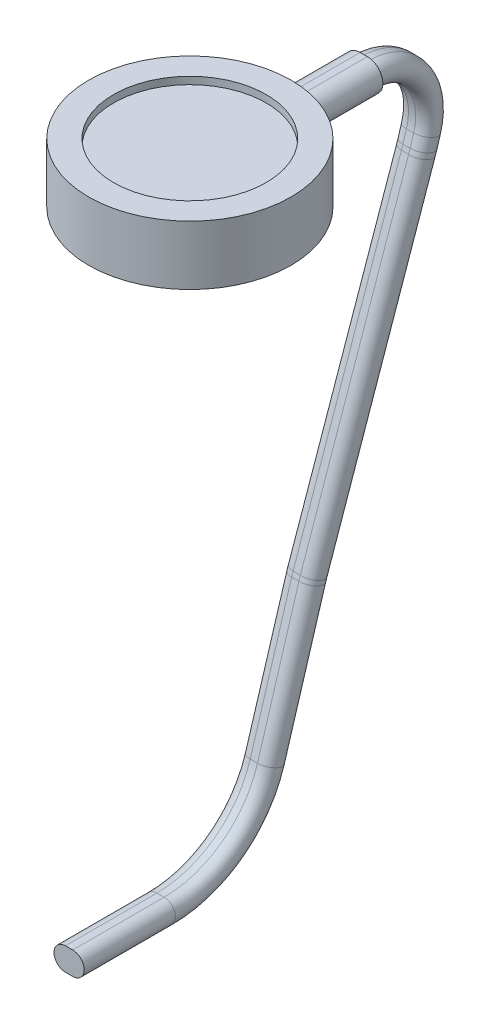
ISO-10303-21;
HEADER;
FILE_DESCRIPTION(('STEP AP214'),'2;1');
FILE_NAME('part.step','',(''),(''),'','','');
FILE_SCHEMA(('AUTOMOTIVE_DESIGN { 1 0 10303 214 1 1 1 1 }'));
ENDSEC;
DATA;
#1=APPLICATION_CONTEXT('core data for automotive mechanical design processes');
#2=APPLICATION_PROTOCOL_DEFINITION('international standard','automotive_design',2000,#1);
#3=PRODUCT_CONTEXT('',#1,'mechanical');
#4=PRODUCT('Part','Part','',(#3));
#5=PRODUCT_RELATED_PRODUCT_CATEGORY('part','',(#4));
#6=PRODUCT_DEFINITION_FORMATION('','',#4);
#7=PRODUCT_DEFINITION_CONTEXT('part definition',#1,'design');
#8=PRODUCT_DEFINITION('design','',#6,#7);
#9=PRODUCT_DEFINITION_SHAPE('','',#8);
#10=(LENGTH_UNIT() NAMED_UNIT(*) SI_UNIT(.MILLI.,.METRE.));
#11=(NAMED_UNIT(*) PLANE_ANGLE_UNIT() SI_UNIT($,.RADIAN.));
#12=(NAMED_UNIT(*) SI_UNIT($,.STERADIAN.) SOLID_ANGLE_UNIT());
#13=UNCERTAINTY_MEASURE_WITH_UNIT(LENGTH_MEASURE(1.E-05),#10,'distance_accuracy_value','');
#14=(GEOMETRIC_REPRESENTATION_CONTEXT(3) GLOBAL_UNCERTAINTY_ASSIGNED_CONTEXT((#13)) GLOBAL_UNIT_ASSIGNED_CONTEXT((#10,
#11,#12)) REPRESENTATION_CONTEXT('',''));
#15=CARTESIAN_POINT('',(0.,0.,0.));
#16=DIRECTION('',(0.,0.,1.));
#17=DIRECTION('',(1.,0.,0.));
#18=AXIS2_PLACEMENT_3D('',#15,#16,#17);
#19=CARTESIAN_POINT('',(0.,0.,-23.925));
#20=DIRECTION('',(0.,0.,-1.));
#21=DIRECTION('',(-1.,0.,0.));
#22=AXIS2_PLACEMENT_3D('',#19,#20,#21);
#23=PLANE('',#22);
#24=CARTESIAN_POINT('',(-0.5,0.,-23.925));
#25=DIRECTION('',(0.,0.,-1.));
#26=DIRECTION('',(-1.,0.,0.));
#27=AXIS2_PLACEMENT_3D('',#24,#25,#26);
#28=CIRCLE('',#27,2.125);
#29=CARTESIAN_POINT('',(-0.5,2.125,-23.925));
#30=VERTEX_POINT('',#29);
#31=CARTESIAN_POINT('',(-0.5,-2.125,-23.925));
#32=VERTEX_POINT('',#31);
#33=EDGE_CURVE('E390',#30,#32,#28,.F.);
#34=ORIENTED_EDGE('',*,*,#33,.F.);
#35=DIRECTION('',(1.,0.,0.));
#36=VECTOR('',#35,1.);
#37=CARTESIAN_POINT('',(-0.5,2.125,-23.925));
#38=LINE('',#37,#36);
#39=CARTESIAN_POINT('',(0.5,2.125,-23.925));
#40=VERTEX_POINT('',#39);
#41=EDGE_CURVE('E389',#30,#40,#38,.T.);
#42=ORIENTED_EDGE('',*,*,#41,.T.);
#43=CARTESIAN_POINT('',(0.5,0.,-23.925));
#44=DIRECTION('',(0.,0.,-1.));
#45=DIRECTION('',(-1.,0.,0.));
#46=AXIS2_PLACEMENT_3D('',#43,#44,#45);
#47=CIRCLE('',#46,2.125);
#48=CARTESIAN_POINT('',(0.500000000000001,-2.125,-23.925));
#49=VERTEX_POINT('',#48);
#50=EDGE_CURVE('E395',#49,#40,#47,.F.);
#51=ORIENTED_EDGE('',*,*,#50,.F.);
#52=DIRECTION('',(1.,0.,0.));
#53=VECTOR('',#52,1.);
#54=CARTESIAN_POINT('',(-0.5,-2.125,-23.925));
#55=LINE('',#54,#53);
#56=EDGE_CURVE('E400',#32,#49,#55,.T.);
#57=ORIENTED_EDGE('',*,*,#56,.F.);
#58=EDGE_LOOP('',(#34,#42,#51,#57));
#59=FACE_BOUND('',#58,.T.);
#60=DIRECTION('',(-1.,0.,0.));
#61=VECTOR('',#60,1.);
#62=CARTESIAN_POINT('',(0.5,-1.575,-23.925));
#63=LINE('',#62,#61);
#64=CARTESIAN_POINT('',(0.5,-1.575,-23.925));
#65=VERTEX_POINT('',#64);
#66=CARTESIAN_POINT('',(-0.5,-1.575,-23.925));
#67=VERTEX_POINT('',#66);
#68=EDGE_CURVE('E364',#65,#67,#63,.T.);
#69=ORIENTED_EDGE('',*,*,#68,.F.);
#70=CARTESIAN_POINT('',(0.5,0.,-23.925));
#71=DIRECTION('',(0.,0.,-1.));
#72=DIRECTION('',(-1.,0.,0.));
#73=AXIS2_PLACEMENT_3D('',#70,#71,#72);
#74=CIRCLE('',#73,1.575);
#75=CARTESIAN_POINT('',(0.5,1.575,-23.925));
#76=VERTEX_POINT('',#75);
#77=EDGE_CURVE('E361',#76,#65,#74,.T.);
#78=ORIENTED_EDGE('',*,*,#77,.F.);
#79=DIRECTION('',(1.,0.,0.));
#80=VECTOR('',#79,1.);
#81=CARTESIAN_POINT('',(0.5,1.575,-23.925));
#82=LINE('',#81,#80);
#83=CARTESIAN_POINT('',(-0.499999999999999,1.575,-23.925));
#84=VERTEX_POINT('',#83);
#85=EDGE_CURVE('E368',#84,#76,#82,.T.);
#86=ORIENTED_EDGE('',*,*,#85,.F.);
#87=CARTESIAN_POINT('',(-0.5,0.,-23.925));
#88=DIRECTION('',(0.,0.,-1.));
#89=DIRECTION('',(-1.,0.,0.));
#90=AXIS2_PLACEMENT_3D('',#87,#88,#89);
#91=CIRCLE('',#90,1.575);
#92=EDGE_CURVE('E52',#67,#84,#91,.T.);
#93=ORIENTED_EDGE('',*,*,#92,.F.);
#94=EDGE_LOOP('',(#69,#78,#86,#93));
#95=FACE_BOUND('',#94,.T.);
#96=ADVANCED_FACE('F33',(#59,#95),#23,.T.);
#97=CARTESIAN_POINT('',(0.,4.075,0.));
#98=DIRECTION('',(0.,-1.,0.));
#99=DIRECTION('',(0.,0.,-1.));
#100=AXIS2_PLACEMENT_3D('',#97,#98,#99);
#101=CYLINDRICAL_SURFACE('',#100,13.925);
#102=CARTESIAN_POINT('',(0.,2.125,0.));
#103=DIRECTION('',(0.,-1.,0.));
#104=DIRECTION('',(0.,0.,-1.));
#105=AXIS2_PLACEMENT_3D('',#102,#103,#104);
#106=CIRCLE('',#105,13.925);
#107=CARTESIAN_POINT('',(-0.5,2.125,-13.9160204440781));
#108=VERTEX_POINT('',#107);
#109=CARTESIAN_POINT('',(0.5,2.125,-13.9160204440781));
#110=VERTEX_POINT('',#109);
#111=EDGE_CURVE('E422',#108,#110,#106,.T.);
#112=ORIENTED_EDGE('',*,*,#111,.F.);
#113=CARTESIAN_POINT('',(0.,2.06533895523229,-13.925));
#114=CARTESIAN_POINT('',(-0.1150638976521,2.09318994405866,-13.924998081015));
#115=CARTESIAN_POINT('',(-0.23252616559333,2.11141849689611,-13.9235590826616));
#116=CARTESIAN_POINT('',(-0.468841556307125,2.1280766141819,-13.9176079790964));
#117=CARTESIAN_POINT('',(-0.587695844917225,2.12648818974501,-13.9130930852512));
#118=CARTESIAN_POINT('',(-0.823265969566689,2.10359578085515,-13.9011422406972));
#119=CARTESIAN_POINT('',(-0.939983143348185,2.08230459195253,-13.8937081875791));
#120=CARTESIAN_POINT('',(-1.1680702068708,2.02070866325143,-13.8763946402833));
#121=CARTESIAN_POINT('',(-1.27944078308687,1.98040637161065,-13.8665154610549));
#122=CARTESIAN_POINT('',(-1.49450048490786,1.88166987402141,-13.8449938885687));
#123=CARTESIAN_POINT('',(-1.59813687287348,1.8231231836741,-13.8333407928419));
#124=CARTESIAN_POINT('',(-1.79415664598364,1.68962954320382,-13.809286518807));
#125=CARTESIAN_POINT('',(-1.88653886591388,1.61468089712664,-13.7968852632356));
#126=CARTESIAN_POINT('',(-2.05854002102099,1.44946860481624,-13.7722796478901));
#127=CARTESIAN_POINT('',(-2.13800013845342,1.3590389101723,-13.7600791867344));
#128=CARTESIAN_POINT('',(-2.28061350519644,1.16595232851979,-13.7371634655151));
#129=CARTESIAN_POINT('',(-2.34376689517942,1.06329554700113,-13.7264481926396));
#130=CARTESIAN_POINT('',(-2.45177705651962,0.848861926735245,-13.7075682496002));
#131=CARTESIAN_POINT('',(-2.4966781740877,0.737107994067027,-13.6993974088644));
#132=CARTESIAN_POINT('',(-2.56701160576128,0.507450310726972,-13.6863935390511));
#133=CARTESIAN_POINT('',(-2.5924461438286,0.389547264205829,-13.6815601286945));
#134=CARTESIAN_POINT('',(-2.62279293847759,0.152912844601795,-13.6757749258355));
#135=CARTESIAN_POINT('',(-2.62801966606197,0.0342232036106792,-13.6747636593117));
#136=CARTESIAN_POINT('',(-2.61865403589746,-0.202337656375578,-13.6765601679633));
#137=CARTESIAN_POINT('',(-2.60406269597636,-0.320208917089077,-13.6793677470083));
#138=CARTESIAN_POINT('',(-2.55572283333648,-0.550816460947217,-13.6884804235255));
#139=CARTESIAN_POINT('',(-2.52212868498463,-0.663586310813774,-13.6947573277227));
#140=CARTESIAN_POINT('',(-2.43691429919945,-0.881884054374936,-13.7101764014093));
#141=CARTESIAN_POINT('',(-2.385292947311,-0.987411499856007,-13.719318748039));
#142=CARTESIAN_POINT('',(-2.26487135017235,-1.18946749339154,-13.7397138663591));
#143=CARTESIAN_POINT('',(-2.19589452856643,-1.28588860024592,-13.7509880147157));
#144=CARTESIAN_POINT('',(-2.04297008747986,-1.46588464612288,-13.7745369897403));
#145=CARTESIAN_POINT('',(-1.95902107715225,-1.54945839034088,-13.7868119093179));
#146=CARTESIAN_POINT('',(-1.77708008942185,-1.70265682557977,-13.8114498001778));
#147=CARTESIAN_POINT('',(-1.67889935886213,-1.77205775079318,-13.8238114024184));
#148=CARTESIAN_POINT('',(-1.47214637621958,-1.89338932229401,-13.8473542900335));
#149=CARTESIAN_POINT('',(-1.36357410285,-1.94531993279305,-13.8585355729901));
#150=CARTESIAN_POINT('',(-1.13904824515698,-2.03018331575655,-13.8787927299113));
#151=CARTESIAN_POINT('',(-1.02309456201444,-2.06311583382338,-13.8878685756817));
#152=CARTESIAN_POINT('',(-0.787115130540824,-2.10894124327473,-13.90323865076));
#153=CARTESIAN_POINT('',(-0.667089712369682,-2.1218357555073,-13.9095331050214));
#154=CARTESIAN_POINT('',(-0.427928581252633,-2.12710218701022,-13.9189314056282));
#155=CARTESIAN_POINT('',(-0.308799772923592,-2.11972151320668,-13.9220730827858));
#156=CARTESIAN_POINT('',(-0.0734156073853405,-2.08513783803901,-13.9253040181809));
#157=CARTESIAN_POINT('',(0.0428398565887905,-2.05793557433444,-13.9253933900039));
#158=CARTESIAN_POINT('',(0.268415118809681,-1.98472579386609,-13.9228672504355));
#159=CARTESIAN_POINT('',(0.377774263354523,-1.9388387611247,-13.92026890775));
#160=CARTESIAN_POINT('',(0.587302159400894,-1.82957929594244,-13.9130048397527));
#161=CARTESIAN_POINT('',(0.687470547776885,-1.76620617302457,-13.9083390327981));
#162=CARTESIAN_POINT('',(0.876432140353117,-1.62332233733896,-13.8977162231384));
#163=CARTESIAN_POINT('',(0.965152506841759,-1.54371588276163,-13.8917515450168));
#164=CARTESIAN_POINT('',(1.12805607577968,-1.3708270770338,-13.8794741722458));
#165=CARTESIAN_POINT('',(1.20223866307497,-1.27754414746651,-13.8731614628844));
#166=CARTESIAN_POINT('',(1.33446591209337,-1.07919542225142,-13.8610706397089));
#167=CARTESIAN_POINT('',(1.39239593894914,-0.974052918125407,-13.8552965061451));
#168=CARTESIAN_POINT('',(1.48977575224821,-0.755468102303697,-13.8451653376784));
#169=CARTESIAN_POINT('',(1.529225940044,-0.642025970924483,-13.8408082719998));
#170=CARTESIAN_POINT('',(1.58841462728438,-0.410369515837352,-13.8341410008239));
#171=CARTESIAN_POINT('',(1.60820480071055,-0.292168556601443,-13.8318254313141));
#172=CARTESIAN_POINT('',(1.62766549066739,-0.0541013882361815,-13.8295491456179));
#173=CARTESIAN_POINT('',(1.62733675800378,0.0657647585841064,-13.8295883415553));
#174=CARTESIAN_POINT('',(1.60663150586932,0.303034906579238,-13.8320086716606));
#175=CARTESIAN_POINT('',(1.58636941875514,0.420449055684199,-13.8343764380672));
#176=CARTESIAN_POINT('',(1.52656392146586,0.650195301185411,-13.8411027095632));
#177=CARTESIAN_POINT('',(1.48702070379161,0.762527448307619,-13.8454611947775));
#178=CARTESIAN_POINT('',(1.38969540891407,0.979187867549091,-13.8555677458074));
#179=CARTESIAN_POINT('',(1.33187738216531,1.08349985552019,-13.8613185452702));
#180=CARTESIAN_POINT('',(1.19963911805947,1.2810066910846,-13.873387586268));
#181=CARTESIAN_POINT('',(1.1252149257,1.37419888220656,-13.8797059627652));
#182=CARTESIAN_POINT('',(0.961318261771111,1.5474125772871,-13.8920220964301));
#183=CARTESIAN_POINT('',(0.871752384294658,1.62734582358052,-13.8980175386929));
#184=CARTESIAN_POINT('',(0.680463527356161,1.77099111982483,-13.9086925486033));
#185=CARTESIAN_POINT('',(0.578752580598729,1.83471903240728,-13.9133734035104));
#186=CARTESIAN_POINT('',(0.397563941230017,1.92798090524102,-13.919525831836));
#187=CARTESIAN_POINT('',(0.320402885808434,1.96205396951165,-13.9215370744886));
#188=CARTESIAN_POINT('',(0.162566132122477,2.02082223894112,-13.9242748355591));
#189=CARTESIAN_POINT('',(0.0818904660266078,2.04551752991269,-13.9250013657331));
#190=CARTESIAN_POINT('',(0.,2.06533895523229,-13.925));
#191=B_SPLINE_CURVE_WITH_KNOTS('',3,(#113,#114,#115,#116,#117,#118,#119,#120,#121,#122,#123,
#124,#125,#126,#127,#128,#129,#130,#131,#132,#133,#134,#135,#136,#137,#138,#139,#140,#141,#142,
#143,#144,#145,#146,#147,#148,#149,#150,#151,#152,#153,#154,#155,#156,#157,#158,#159,#160,#161,
#162,#163,#164,#165,#166,#167,#168,#169,#170,#171,#172,#173,#174,#175,#176,#177,#178,#179,#180,
#181,#182,#183,#184,#185,#186,#187,#188,#189,#190),.UNSPECIFIED.,.T.,.F.,(4,2,2,2,2,2,2,2,2,2,2,
2,2,2,2,2,2,2,2,2,2,2,2,2,2,2,2,2,2,2,2,2,2,2,2,2,2,2,4),(0.,0.354853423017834,
0.710028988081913,1.06497405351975,1.41987342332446,1.77700569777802,2.13417491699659,
2.49544732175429,2.85671660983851,3.21710282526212,3.57744786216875,3.93216214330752,
4.2868582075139,4.63871335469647,4.99059025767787,5.34620318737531,5.70184916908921,
6.0627373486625,6.42362626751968,6.78452001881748,7.14538457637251,7.5018653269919,
7.85833281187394,8.21253721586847,8.5667556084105,8.9231269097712,9.27951328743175,
9.63835356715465,9.99718605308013,10.3550728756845,10.7129463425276,11.068777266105,
11.4246046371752,11.7811363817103,12.1377531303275,12.496655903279,12.8552059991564,
13.1077559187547,13.3603035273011),.UNSPECIFIED.);
#192=CARTESIAN_POINT('',(-0.5,-2.125,-13.9160204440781));
#193=VERTEX_POINT('',#192);
#194=EDGE_CURVE('E12',#108,#193,#191,.T.);
#195=ORIENTED_EDGE('',*,*,#194,.T.);
#196=CARTESIAN_POINT('',(0.,-2.125,0.));
#197=DIRECTION('',(0.,-1.,0.));
#198=DIRECTION('',(0.,0.,-1.));
#199=AXIS2_PLACEMENT_3D('',#196,#197,#198);
#200=CIRCLE('',#199,13.925);
#201=CARTESIAN_POINT('',(0.500000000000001,-2.125,-13.9160204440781));
#202=VERTEX_POINT('',#201);
#203=EDGE_CURVE('E45',#193,#202,#200,.T.);
#204=ORIENTED_EDGE('',*,*,#203,.T.);
#205=CARTESIAN_POINT('',(0.,2.06533895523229,-13.925));
#206=CARTESIAN_POINT('',(-0.115595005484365,2.03734943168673,-13.9249984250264));
#207=CARTESIAN_POINT('',(-0.228902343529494,1.99961563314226,-13.92354662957));
#208=CARTESIAN_POINT('',(-0.447638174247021,1.90572838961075,-13.9182347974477));
#209=CARTESIAN_POINT('',(-0.553058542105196,1.84955626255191,-13.9143723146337));
#210=CARTESIAN_POINT('',(-0.752902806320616,1.72046366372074,-13.9049908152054));
#211=CARTESIAN_POINT('',(-0.847334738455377,1.64755554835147,-13.8994730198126));
#212=CARTESIAN_POINT('',(-1.0226521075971,1.48703780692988,-13.8876759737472));
#213=CARTESIAN_POINT('',(-1.10353980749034,1.39943064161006,-13.8813968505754));
#214=CARTESIAN_POINT('',(-1.24997007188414,1.21140675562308,-13.8689813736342));
#215=CARTESIAN_POINT('',(-1.31542428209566,1.11092113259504,-13.8628460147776));
#216=CARTESIAN_POINT('',(-1.42855071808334,0.900334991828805,-13.8516466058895));
#217=CARTESIAN_POINT('',(-1.47622264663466,0.790234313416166,-13.8465825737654));
#218=CARTESIAN_POINT('',(-1.55238517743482,0.563582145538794,-13.8382514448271));
#219=CARTESIAN_POINT('',(-1.58088565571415,0.447034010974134,-13.8349834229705));
#220=CARTESIAN_POINT('',(-1.61789957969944,0.210767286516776,-13.8307042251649));
#221=CARTESIAN_POINT('',(-1.62641389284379,0.0910488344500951,-13.8296929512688));
#222=CARTESIAN_POINT('',(-1.62321301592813,-0.147366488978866,-13.8300688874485));
#223=CARTESIAN_POINT('',(-1.61162314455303,-0.26606508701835,-13.8314412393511));
#224=CARTESIAN_POINT('',(-1.56879871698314,-0.499815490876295,-13.836363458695));
#225=CARTESIAN_POINT('',(-1.53756408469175,-0.614867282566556,-13.8399133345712));
#226=CARTESIAN_POINT('',(-1.45635769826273,-0.838091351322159,-13.8486932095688));
#227=CARTESIAN_POINT('',(-1.40638484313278,-0.946263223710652,-13.8539233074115));
#228=CARTESIAN_POINT('',(-1.28912136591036,-1.15272078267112,-13.86532535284));
#229=CARTESIAN_POINT('',(-1.22182993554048,-1.25100600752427,-13.8714973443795));
#230=CARTESIAN_POINT('',(-1.07133086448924,-1.43555173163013,-13.8839329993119));
#231=CARTESIAN_POINT('',(-0.988026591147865,-1.52173342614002,-13.8901969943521));
#232=CARTESIAN_POINT('',(-0.808098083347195,-1.67892069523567,-13.9018240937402));
#233=CARTESIAN_POINT('',(-0.711473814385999,-1.74992623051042,-13.9071871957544));
#234=CARTESIAN_POINT('',(-0.507562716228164,-1.87476367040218,-13.9161204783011));
#235=CARTESIAN_POINT('',(-0.40027109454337,-1.92858780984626,-13.9196898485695));
#236=CARTESIAN_POINT('',(-0.17812054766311,-2.01744561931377,-13.9243034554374));
#237=CARTESIAN_POINT('',(-0.0632620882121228,-2.05248044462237,-13.9253478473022));
#238=CARTESIAN_POINT('',(0.169752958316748,-2.10253367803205,-13.9244485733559));
#239=CARTESIAN_POINT('',(0.287875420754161,-2.11771144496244,-13.922528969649));
#240=CARTESIAN_POINT('',(0.524904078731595,-2.12816284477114,-13.9156083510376));
#241=CARTESIAN_POINT('',(0.643810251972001,-2.123437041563,-13.9106074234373));
#242=CARTESIAN_POINT('',(0.878575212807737,-2.09433649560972,-13.8977517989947));
#243=CARTESIAN_POINT('',(0.994443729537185,-2.07003526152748,-13.889907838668));
#244=CARTESIAN_POINT('',(1.22038703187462,-2.00264029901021,-13.8718828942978));
#245=CARTESIAN_POINT('',(1.33046148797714,-1.95954550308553,-13.8617017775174));
#246=CARTESIAN_POINT('',(1.54279365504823,-1.85534850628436,-13.8396863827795));
#247=CARTESIAN_POINT('',(1.64497183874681,-1.79408727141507,-13.8278380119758));
#248=CARTESIAN_POINT('',(1.8376428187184,-1.65542348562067,-13.8035552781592));
#249=CARTESIAN_POINT('',(1.92813467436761,-1.57801963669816,-13.7911208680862));
#250=CARTESIAN_POINT('',(2.09589755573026,-1.40823733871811,-13.7666305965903));
#251=CARTESIAN_POINT('',(2.17301308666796,-1.31570430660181,-13.7545803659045));
#252=CARTESIAN_POINT('',(2.31060699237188,-1.11881641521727,-13.7321373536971));
#253=CARTESIAN_POINT('',(2.371085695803,-1.01446178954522,-13.7217445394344));
#254=CARTESIAN_POINT('',(2.47341444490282,-0.79725532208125,-13.7036691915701));
#255=CARTESIAN_POINT('',(2.51533524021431,-0.684437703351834,-13.695976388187));
#256=CARTESIAN_POINT('',(2.57957868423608,-0.453182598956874,-13.6840227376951));
#257=CARTESIAN_POINT('',(2.60190358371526,-0.334745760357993,-13.6797614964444));
#258=CARTESIAN_POINT('',(2.62604567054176,-0.0976298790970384,-13.675147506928));
#259=CARTESIAN_POINT('',(2.62818277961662,0.0210154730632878,-13.6747337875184));
#260=CARTESIAN_POINT('',(2.61271685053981,0.25695993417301,-13.6776970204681));
#261=CARTESIAN_POINT('',(2.59511462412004,0.374259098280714,-13.6810738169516));
#262=CARTESIAN_POINT('',(2.54090956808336,0.603393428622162,-13.6912435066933));
#263=CARTESIAN_POINT('',(2.50443343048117,0.715259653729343,-13.6980136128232));
#264=CARTESIAN_POINT('',(2.41364986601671,0.93128924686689,-13.7143003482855));
#265=CARTESIAN_POINT('',(2.35934120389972,1.03545208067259,-13.7238171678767));
#266=CARTESIAN_POINT('',(2.23370832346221,1.23445914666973,-13.7448267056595));
#267=CARTESIAN_POINT('',(2.16219204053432,1.32917978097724,-13.7563412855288));
#268=CARTESIAN_POINT('',(2.00448213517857,1.50537038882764,-13.7802040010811));
#269=CARTESIAN_POINT('',(1.91828761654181,1.58683955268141,-13.7925521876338));
#270=CARTESIAN_POINT('',(1.7322428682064,1.73538723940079,-13.8171585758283));
#271=CARTESIAN_POINT('',(1.63221811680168,1.80224797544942,-13.8294130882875));
#272=CARTESIAN_POINT('',(1.42218839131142,1.91822429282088,-13.8525864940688));
#273=CARTESIAN_POINT('',(1.31218154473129,1.96733653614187,-13.8635051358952));
#274=CARTESIAN_POINT('',(1.08539291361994,2.046300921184,-13.8831007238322));
#275=CARTESIAN_POINT('',(0.968617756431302,2.07617156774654,-13.8917798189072));
#276=CARTESIAN_POINT('',(0.731608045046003,2.115747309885,-13.9062728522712));
#277=CARTESIAN_POINT('',(0.61137729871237,2.12547379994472,-13.9120898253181));
#278=CARTESIAN_POINT('',(0.40856223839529,2.12464344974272,-13.9192521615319));
#279=CARTESIAN_POINT('',(0.325946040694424,2.11947201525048,-13.9214266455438));
#280=CARTESIAN_POINT('',(0.161851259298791,2.09955019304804,-13.9243011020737));
#281=CARTESIAN_POINT('',(0.080372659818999,2.08479993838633,-13.9250010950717));
#282=CARTESIAN_POINT('',(0.,2.06533895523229,-13.925));
#283=B_SPLINE_CURVE_WITH_KNOTS('',3,(#205,#206,#207,#208,#209,#210,#211,#212,#213,#214,#215,
#216,#217,#218,#219,#220,#221,#222,#223,#224,#225,#226,#227,#228,#229,#230,#231,#232,#233,#234,
#235,#236,#237,#238,#239,#240,#241,#242,#243,#244,#245,#246,#247,#248,#249,#250,#251,#252,#253,
#254,#255,#256,#257,#258,#259,#260,#261,#262,#263,#264,#265,#266,#267,#268,#269,#270,#271,#272,
#273,#274,#275,#276,#277,#278,#279,#280,#281,#282),.UNSPECIFIED.,.T.,.F.,(4,2,2,2,2,2,2,2,2,2,2,
2,2,2,2,2,2,2,2,2,2,2,2,2,2,2,2,2,2,2,2,2,2,2,2,2,2,2,4),(0.,0.356503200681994,
0.713368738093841,1.06997163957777,1.42651490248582,1.78505228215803,2.14359565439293,
2.50195418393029,2.86029715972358,3.21641443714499,3.57253309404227,3.92867267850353,
4.28482888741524,4.64320599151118,5.00158402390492,5.3601237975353,5.71864152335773,
6.07426402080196,6.42987644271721,6.78415967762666,7.13846303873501,7.49596454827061,
7.85349481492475,8.21493713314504,8.57637231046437,8.93641743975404,9.29642120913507,
9.65071013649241,10.0049844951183,10.3569110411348,10.7088619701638,11.0649400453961,
11.4210398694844,11.7821325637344,12.1432931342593,12.5041058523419,12.8645351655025,
13.112413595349,13.360288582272),.UNSPECIFIED.);
#284=EDGE_CURVE('E427',#202,#110,#283,.T.);
#285=ORIENTED_EDGE('',*,*,#284,.T.);
#286=EDGE_LOOP('',(#112,#195,#204,#285));
#287=FACE_BOUND('',#286,.T.);
#288=CARTESIAN_POINT('',(0.,4.075,0.));
#289=DIRECTION('',(0.,1.,0.));
#290=DIRECTION('',(0.,0.,1.));
#291=AXIS2_PLACEMENT_3D('',#288,#289,#290);
#292=CIRCLE('',#291,13.925);
#293=CARTESIAN_POINT('',(0.,4.075,13.925));
#294=VERTEX_POINT('',#293);
#295=EDGE_CURVE('E419',#294,#294,#292,.T.);
#296=ORIENTED_EDGE('',*,*,#295,.F.);
#297=EDGE_LOOP('',(#296));
#298=FACE_BOUND('',#297,.T.);
#299=CARTESIAN_POINT('',(0.,-4.075,0.));
#300=DIRECTION('',(0.,1.,0.));
#301=DIRECTION('',(0.,0.,1.));
#302=AXIS2_PLACEMENT_3D('',#299,#300,#301);
#303=CIRCLE('',#302,13.925);
#304=CARTESIAN_POINT('',(0.,-4.075,13.925));
#305=VERTEX_POINT('',#304);
#306=EDGE_CURVE('E416',#305,#305,#303,.T.);
#307=ORIENTED_EDGE('',*,*,#306,.T.);
#308=EDGE_LOOP('',(#307));
#309=FACE_BOUND('',#308,.T.);
#310=ADVANCED_FACE('F35',(#287,#298,#309),#101,.T.);
#311=CARTESIAN_POINT('',(0.,4.075,0.));
#312=DIRECTION('',(0.,1.,0.));
#313=DIRECTION('',(0.,0.,1.));
#314=AXIS2_PLACEMENT_3D('',#311,#312,#313);
#315=PLANE('',#314);
#316=CARTESIAN_POINT('',(0.,4.075,0.));
#317=DIRECTION('',(0.,1.,0.));
#318=DIRECTION('',(0.,0.,1.));
#319=AXIS2_PLACEMENT_3D('',#316,#317,#318);
#320=CIRCLE('',#319,10.5);
#321=CARTESIAN_POINT('',(0.,4.075,10.5));
#322=VERTEX_POINT('',#321);
#323=EDGE_CURVE('E412',#322,#322,#320,.T.);
#324=ORIENTED_EDGE('',*,*,#323,.F.);
#325=EDGE_LOOP('',(#324));
#326=FACE_BOUND('',#325,.T.);
#327=ORIENTED_EDGE('',*,*,#295,.T.);
#328=EDGE_LOOP('',(#327));
#329=FACE_BOUND('',#328,.T.);
#330=ADVANCED_FACE('F459',(#326,#329),#315,.T.);
#331=CARTESIAN_POINT('',(0.,-4.075,0.));
#332=DIRECTION('',(0.,1.,0.));
#333=DIRECTION('',(0.,0.,1.));
#334=AXIS2_PLACEMENT_3D('',#331,#332,#333);
#335=PLANE('',#334);
#336=ORIENTED_EDGE('',*,*,#306,.F.);
#337=EDGE_LOOP('',(#336));
#338=FACE_BOUND('',#337,.T.);
#339=ADVANCED_FACE('F457',(#338),#335,.F.);
#340=CARTESIAN_POINT('',(0.,3.075,0.));
#341=DIRECTION('',(0.,1.,0.));
#342=DIRECTION('',(0.,0.,1.));
#343=AXIS2_PLACEMENT_3D('',#340,#341,#342);
#344=CYLINDRICAL_SURFACE('',#343,10.5);
#345=CARTESIAN_POINT('',(0.,3.075,0.));
#346=DIRECTION('',(0.,1.,0.));
#347=DIRECTION('',(0.,0.,1.));
#348=AXIS2_PLACEMENT_3D('',#345,#346,#347);
#349=CIRCLE('',#348,10.5);
#350=CARTESIAN_POINT('',(0.,3.075,10.5));
#351=VERTEX_POINT('',#350);
#352=EDGE_CURVE('E413',#351,#351,#349,.T.);
#353=ORIENTED_EDGE('',*,*,#352,.F.);
#354=EDGE_LOOP('',(#353));
#355=FACE_BOUND('',#354,.T.);
#356=ORIENTED_EDGE('',*,*,#323,.T.);
#357=EDGE_LOOP('',(#356));
#358=FACE_BOUND('',#357,.T.);
#359=ADVANCED_FACE('F453',(#355,#358),#344,.F.);
#360=CARTESIAN_POINT('',(0.,3.075,0.));
#361=DIRECTION('',(0.,1.,0.));
#362=DIRECTION('',(0.,0.,1.));
#363=AXIS2_PLACEMENT_3D('',#360,#361,#362);
#364=PLANE('',#363);
#365=ORIENTED_EDGE('',*,*,#352,.T.);
#366=EDGE_LOOP('',(#365));
#367=FACE_BOUND('',#366,.T.);
#368=ADVANCED_FACE('F446',(#367),#364,.T.);
#369=CARTESIAN_POINT('',(-0.5,0.,-40.6796280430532));
#370=DIRECTION('',(0.,0.,1.));
#371=DIRECTION('',(1.,0.,0.));
#372=AXIS2_PLACEMENT_3D('',#369,#370,#371);
#373=CYLINDRICAL_SURFACE('',#372,2.125);
#374=ORIENTED_EDGE('',*,*,#194,.F.);
#375=DIRECTION('',(0.,0.,1.));
#376=VECTOR('',#375,1.);
#377=CARTESIAN_POINT('',(-0.5,2.125,-40.6796280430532));
#378=LINE('',#377,#376);
#379=EDGE_CURVE('E405',#30,#108,#378,.T.);
#380=ORIENTED_EDGE('',*,*,#379,.F.);
#381=ORIENTED_EDGE('',*,*,#33,.T.);
#382=DIRECTION('',(0.,0.,1.));
#383=VECTOR('',#382,1.);
#384=CARTESIAN_POINT('',(-0.5,-2.125,-40.6796280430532));
#385=LINE('',#384,#383);
#386=EDGE_CURVE('E393',#32,#193,#385,.T.);
#387=ORIENTED_EDGE('',*,*,#386,.T.);
#388=EDGE_LOOP('',(#374,#380,#381,#387));
#389=FACE_BOUND('',#388,.T.);
#390=ADVANCED_FACE('F437',(#389),#373,.T.);
#391=CARTESIAN_POINT('',(0.5,0.,-40.6796280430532));
#392=DIRECTION('',(0.,0.,1.));
#393=DIRECTION('',(1.,0.,0.));
#394=AXIS2_PLACEMENT_3D('',#391,#392,#393);
#395=CYLINDRICAL_SURFACE('',#394,2.125);
#396=ORIENTED_EDGE('',*,*,#284,.F.);
#397=DIRECTION('',(0.,0.,1.));
#398=VECTOR('',#397,1.);
#399=CARTESIAN_POINT('',(0.500000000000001,-2.125,-40.6796280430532));
#400=LINE('',#399,#398);
#401=EDGE_CURVE('E399',#49,#202,#400,.T.);
#402=ORIENTED_EDGE('',*,*,#401,.F.);
#403=ORIENTED_EDGE('',*,*,#50,.T.);
#404=DIRECTION('',(0.,0.,1.));
#405=VECTOR('',#404,1.);
#406=CARTESIAN_POINT('',(0.5,2.125,-40.6796280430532));
#407=LINE('',#406,#405);
#408=EDGE_CURVE('E398',#40,#110,#407,.T.);
#409=ORIENTED_EDGE('',*,*,#408,.T.);
#410=EDGE_LOOP('',(#396,#402,#403,#409));
#411=FACE_BOUND('',#410,.T.);
#412=ADVANCED_FACE('F431',(#411),#395,.T.);
#413=CARTESIAN_POINT('',(-0.5,-2.125,-40.6796280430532));
#414=DIRECTION('',(0.,-1.,0.));
#415=DIRECTION('',(0.,0.,-1.));
#416=AXIS2_PLACEMENT_3D('',#413,#414,#415);
#417=PLANE('',#416);
#418=ORIENTED_EDGE('',*,*,#203,.F.);
#419=ORIENTED_EDGE('',*,*,#386,.F.);
#420=ORIENTED_EDGE('',*,*,#56,.T.);
#421=ORIENTED_EDGE('',*,*,#401,.T.);
#422=EDGE_LOOP('',(#418,#419,#420,#421));
#423=FACE_BOUND('',#422,.T.);
#424=ADVANCED_FACE('F436',(#423),#417,.T.);
#425=CARTESIAN_POINT('',(-0.5,2.125,-40.6796280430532));
#426=DIRECTION('',(0.,-1.,0.));
#427=DIRECTION('',(0.,0.,-1.));
#428=AXIS2_PLACEMENT_3D('',#425,#426,#427);
#429=PLANE('',#428);
#430=ORIENTED_EDGE('',*,*,#379,.T.);
#431=ORIENTED_EDGE('',*,*,#111,.T.);
#432=ORIENTED_EDGE('',*,*,#408,.F.);
#433=ORIENTED_EDGE('',*,*,#41,.F.);
#434=EDGE_LOOP('',(#430,#431,#432,#433));
#435=FACE_BOUND('',#434,.T.);
#436=ADVANCED_FACE('F439',(#435),#429,.F.);
#437=CARTESIAN_POINT('',(0.5,-8.22684226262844,-23.925));
#438=DIRECTION('',(1.,0.,0.));
#439=DIRECTION('',(0.,0.,-1.));
#440=AXIS2_PLACEMENT_3D('',#437,#438,#439);
#441=TOROIDAL_SURFACE('',#440,8.22684226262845,1.575);
#442=CARTESIAN_POINT('',(0.5,-8.22684226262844,-23.925));
#443=DIRECTION('',(1.,0.,0.));
#444=DIRECTION('',(0.,0.,-1.));
#445=AXIS2_PLACEMENT_3D('',#442,#443,#444);
#446=CIRCLE('',#445,6.65184226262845);
#447=CARTESIAN_POINT('',(0.5,-10.1524782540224,-30.2920190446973));
#448=VERTEX_POINT('',#447);
#449=EDGE_CURVE('E387',#448,#65,#446,.T.);
#450=ORIENTED_EDGE('',*,*,#449,.F.);
#451=CARTESIAN_POINT('',(0.5,-10.6084236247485,-31.799579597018));
#452=DIRECTION('',(0.,-0.957181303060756,0.289489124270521));
#453=DIRECTION('',(-1.,0.,0.));
#454=AXIS2_PLACEMENT_3D('',#451,#452,#453);
#455=CIRCLE('',#454,1.575);
#456=CARTESIAN_POINT('',(0.5,-11.0643689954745,-33.3071401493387));
#457=VERTEX_POINT('',#456);
#458=EDGE_CURVE('E371',#457,#448,#455,.T.);
#459=ORIENTED_EDGE('',*,*,#458,.F.);
#460=CARTESIAN_POINT('',(0.5,-8.22684226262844,-23.925));
#461=DIRECTION('',(1.,0.,0.));
#462=DIRECTION('',(0.,0.,-1.));
#463=AXIS2_PLACEMENT_3D('',#460,#461,#462);
#464=CIRCLE('',#463,9.80184226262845);
#465=EDGE_CURVE('E381',#457,#76,#464,.T.);
#466=ORIENTED_EDGE('',*,*,#465,.T.);
#467=ORIENTED_EDGE('',*,*,#77,.T.);
#468=EDGE_LOOP('',(#450,#459,#466,#467));
#469=FACE_BOUND('',#468,.T.);
#470=ADVANCED_FACE('F492',(#469),#441,.T.);
#471=CARTESIAN_POINT('',(0.,-8.22684226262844,-23.925));
#472=DIRECTION('',(1.,0.,0.));
#473=DIRECTION('',(0.,0.,-1.));
#474=AXIS2_PLACEMENT_3D('',#471,#472,#473);
#475=CYLINDRICAL_SURFACE('',#474,6.65184226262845);
#476=CARTESIAN_POINT('',(-0.5,-8.22684226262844,-23.925));
#477=DIRECTION('',(1.,0.,0.));
#478=DIRECTION('',(0.,0.,-1.));
#479=AXIS2_PLACEMENT_3D('',#476,#477,#478);
#480=CIRCLE('',#479,6.65184226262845);
#481=CARTESIAN_POINT('',(-0.5,-10.1524782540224,-30.2920190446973));
#482=VERTEX_POINT('',#481);
#483=EDGE_CURVE('E385',#482,#67,#480,.T.);
#484=ORIENTED_EDGE('',*,*,#483,.F.);
#485=DIRECTION('',(-1.,0.,0.));
#486=VECTOR('',#485,1.);
#487=CARTESIAN_POINT('',(0.5,-10.1524782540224,-30.2920190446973));
#488=LINE('',#487,#486);
#489=EDGE_CURVE('E373',#448,#482,#488,.T.);
#490=ORIENTED_EDGE('',*,*,#489,.F.);
#491=ORIENTED_EDGE('',*,*,#449,.T.);
#492=ORIENTED_EDGE('',*,*,#68,.T.);
#493=EDGE_LOOP('',(#484,#490,#491,#492));
#494=FACE_BOUND('',#493,.T.);
#495=ADVANCED_FACE('F486',(#494),#475,.F.);
#496=CARTESIAN_POINT('',(-0.5,-8.22684226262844,-23.925));
#497=DIRECTION('',(1.,0.,0.));
#498=DIRECTION('',(0.,0.,-1.));
#499=AXIS2_PLACEMENT_3D('',#496,#497,#498);
#500=TOROIDAL_SURFACE('',#499,8.22684226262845,1.575);
#501=CARTESIAN_POINT('',(-0.499999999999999,-8.22684226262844,-23.925));
#502=DIRECTION('',(1.,0.,0.));
#503=DIRECTION('',(0.,0.,-1.));
#504=AXIS2_PLACEMENT_3D('',#501,#502,#503);
#505=CIRCLE('',#504,9.80184226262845);
#506=CARTESIAN_POINT('',(-0.499999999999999,-11.0643689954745,-33.3071401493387));
#507=VERTEX_POINT('',#506);
#508=EDGE_CURVE('E383',#507,#84,#505,.T.);
#509=ORIENTED_EDGE('',*,*,#508,.F.);
#510=CARTESIAN_POINT('',(-0.5,-10.6084236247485,-31.799579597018));
#511=DIRECTION('',(0.,-0.957181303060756,0.289489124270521));
#512=DIRECTION('',(-1.,0.,0.));
#513=AXIS2_PLACEMENT_3D('',#510,#511,#512);
#514=CIRCLE('',#513,1.575);
#515=EDGE_CURVE('E376',#482,#507,#514,.T.);
#516=ORIENTED_EDGE('',*,*,#515,.F.);
#517=ORIENTED_EDGE('',*,*,#483,.T.);
#518=ORIENTED_EDGE('',*,*,#92,.T.);
#519=EDGE_LOOP('',(#509,#516,#517,#518));
#520=FACE_BOUND('',#519,.T.);
#521=ADVANCED_FACE('F496',(#520),#500,.T.);
#522=CARTESIAN_POINT('',(0.,-8.22684226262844,-23.925));
#523=DIRECTION('',(1.,0.,0.));
#524=DIRECTION('',(0.,0.,-1.));
#525=AXIS2_PLACEMENT_3D('',#522,#523,#524);
#526=CYLINDRICAL_SURFACE('',#525,9.80184226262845);
#527=DIRECTION('',(1.,0.,0.));
#528=VECTOR('',#527,1.);
#529=CARTESIAN_POINT('',(0.5,-11.0643689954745,-33.3071401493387));
#530=LINE('',#529,#528);
#531=EDGE_CURVE('E378',#507,#457,#530,.T.);
#532=ORIENTED_EDGE('',*,*,#531,.F.);
#533=ORIENTED_EDGE('',*,*,#508,.T.);
#534=ORIENTED_EDGE('',*,*,#85,.T.);
#535=ORIENTED_EDGE('',*,*,#465,.F.);
#536=EDGE_LOOP('',(#532,#533,#534,#535));
#537=FACE_BOUND('',#536,.T.);
#538=ADVANCED_FACE('F495',(#537),#526,.T.);
#539=CARTESIAN_POINT('',(-0.500000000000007,-11.750299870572,-29.8087751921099));
#540=DIRECTION('',(0.,0.289489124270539,0.957181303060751));
#541=DIRECTION('',(0.,-0.957181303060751,0.289489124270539));
#542=AXIS2_PLACEMENT_3D('',#539,#540,#541);
#543=PLANE('',#542);
#544=DIRECTION('',(1.,0.,0.));
#545=VECTOR('',#544,1.);
#546=CARTESIAN_POINT('',(-0.500000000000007,-11.750299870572,-29.8087751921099));
#547=LINE('',#546,#545);
#548=CARTESIAN_POINT('',(-0.500000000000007,-11.750299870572,-29.8087751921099));
#549=VERTEX_POINT('',#548);
#550=CARTESIAN_POINT('',(0.499999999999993,-11.750299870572,-29.8087751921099));
#551=VERTEX_POINT('',#550);
#552=EDGE_CURVE('E334',#549,#551,#547,.T.);
#553=ORIENTED_EDGE('',*,*,#552,.T.);
#554=DIRECTION('',(0.,0.957181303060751,-0.289489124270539));
#555=VECTOR('',#554,1.);
#556=CARTESIAN_POINT('',(0.499999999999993,-11.750299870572,-29.8087751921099));
#557=LINE('',#556,#555);
#558=EDGE_CURVE('E355',#551,#448,#557,.T.);
#559=ORIENTED_EDGE('',*,*,#558,.T.);
#560=ORIENTED_EDGE('',*,*,#489,.T.);
#561=DIRECTION('',(0.,0.957181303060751,-0.289489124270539));
#562=VECTOR('',#561,1.);
#563=CARTESIAN_POINT('',(-0.500000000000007,-11.750299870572,-29.8087751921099));
#564=LINE('',#563,#562);
#565=EDGE_CURVE('E358',#549,#482,#564,.T.);
#566=ORIENTED_EDGE('',*,*,#565,.F.);
#567=EDGE_LOOP('',(#553,#559,#560,#566));
#568=FACE_BOUND('',#567,.T.);
#569=ADVANCED_FACE('F499',(#568),#543,.T.);
#570=CARTESIAN_POINT('',(0.499999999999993,-12.2062452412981,-31.3163357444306));
#571=DIRECTION('',(0.,0.957181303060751,-0.289489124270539));
#572=DIRECTION('',(0.,0.289489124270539,0.957181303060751));
#573=AXIS2_PLACEMENT_3D('',#570,#571,#572);
#574=CYLINDRICAL_SURFACE('',#573,1.575);
#575=CARTESIAN_POINT('',(0.499999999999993,-12.2062452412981,-31.3163357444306));
#576=DIRECTION('',(0.,0.95718130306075,-0.28948912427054));
#577=DIRECTION('',(0.,0.28948912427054,0.95718130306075));
#578=AXIS2_PLACEMENT_3D('',#575,#576,#577);
#579=CIRCLE('',#578,1.575);
#580=CARTESIAN_POINT('',(0.499999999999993,-12.6621906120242,-32.8238962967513));
#581=VERTEX_POINT('',#580);
#582=EDGE_CURVE('E331',#551,#581,#579,.T.);
#583=ORIENTED_EDGE('',*,*,#582,.T.);
#584=DIRECTION('',(0.,0.957181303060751,-0.289489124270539));
#585=VECTOR('',#584,1.);
#586=CARTESIAN_POINT('',(0.499999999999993,-12.6621906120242,-32.8238962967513));
#587=LINE('',#586,#585);
#588=EDGE_CURVE('E352',#581,#457,#587,.T.);
#589=ORIENTED_EDGE('',*,*,#588,.T.);
#590=ORIENTED_EDGE('',*,*,#458,.T.);
#591=ORIENTED_EDGE('',*,*,#558,.F.);
#592=EDGE_LOOP('',(#583,#589,#590,#591));
#593=FACE_BOUND('',#592,.T.);
#594=ADVANCED_FACE('F558',(#593),#574,.T.);
#595=CARTESIAN_POINT('',(-0.500000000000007,-12.6621906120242,-32.8238962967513));
#596=DIRECTION('',(0.,-0.289489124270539,-0.957181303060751));
#597=DIRECTION('',(0.,0.957181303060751,-0.289489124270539));
#598=AXIS2_PLACEMENT_3D('',#595,#596,#597);
#599=PLANE('',#598);
#600=DIRECTION('',(-1.,0.,0.));
#601=VECTOR('',#600,1.);
#602=CARTESIAN_POINT('',(-0.500000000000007,-12.6621906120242,-32.8238962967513));
#603=LINE('',#602,#601);
#604=CARTESIAN_POINT('',(-0.500000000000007,-12.6621906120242,-32.8238962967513));
#605=VERTEX_POINT('',#604);
#606=EDGE_CURVE('E328',#581,#605,#603,.T.);
#607=ORIENTED_EDGE('',*,*,#606,.T.);
#608=DIRECTION('',(0.,0.957181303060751,-0.289489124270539));
#609=VECTOR('',#608,1.);
#610=CARTESIAN_POINT('',(-0.500000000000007,-12.6621906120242,-32.8238962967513));
#611=LINE('',#610,#609);
#612=EDGE_CURVE('E349',#605,#507,#611,.T.);
#613=ORIENTED_EDGE('',*,*,#612,.T.);
#614=ORIENTED_EDGE('',*,*,#531,.T.);
#615=ORIENTED_EDGE('',*,*,#588,.F.);
#616=EDGE_LOOP('',(#607,#613,#614,#615));
#617=FACE_BOUND('',#616,.T.);
#618=ADVANCED_FACE('F560',(#617),#599,.T.);
#619=CARTESIAN_POINT('',(-0.500000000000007,-12.2062452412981,-31.3163357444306));
#620=DIRECTION('',(0.,0.957181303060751,-0.289489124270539));
#621=DIRECTION('',(0.,0.289489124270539,0.957181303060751));
#622=AXIS2_PLACEMENT_3D('',#619,#620,#621);
#623=CYLINDRICAL_SURFACE('',#622,1.575);
#624=CARTESIAN_POINT('',(-0.500000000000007,-12.2062452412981,-31.3163357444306));
#625=DIRECTION('',(0.,0.95718130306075,-0.28948912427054));
#626=DIRECTION('',(0.,0.28948912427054,0.95718130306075));
#627=AXIS2_PLACEMENT_3D('',#624,#625,#626);
#628=CIRCLE('',#627,1.575);
#629=EDGE_CURVE('E325',#605,#549,#628,.T.);
#630=ORIENTED_EDGE('',*,*,#629,.T.);
#631=ORIENTED_EDGE('',*,*,#565,.T.);
#632=ORIENTED_EDGE('',*,*,#515,.T.);
#633=ORIENTED_EDGE('',*,*,#612,.F.);
#634=EDGE_LOOP('',(#630,#631,#632,#633));
#635=FACE_BOUND('',#634,.T.);
#636=ADVANCED_FACE('F500',(#635),#623,.T.);
#637=CARTESIAN_POINT('',(-0.510660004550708,-12.3673860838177,-29.6221441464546));
#638=DIRECTION('',(0.,0.28948912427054,0.95718130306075));
#639=DIRECTION('',(0.,-0.95718130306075,0.28948912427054));
#640=AXIS2_PLACEMENT_3D('',#637,#638,#639);
#641=PLANE('',#640);
#642=DIRECTION('',(0.999453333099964,-0.0316454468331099,0.00957082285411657));
#643=VECTOR('',#642,1.);
#644=CARTESIAN_POINT('',(-0.510660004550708,-12.3673860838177,-29.6221441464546));
#645=LINE('',#644,#643);
#646=CARTESIAN_POINT('',(-0.510660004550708,-12.3673860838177,-29.6221441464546));
#647=VERTEX_POINT('',#646);
#648=CARTESIAN_POINT('',(0.488793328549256,-12.3990315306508,-29.6125733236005));
#649=VERTEX_POINT('',#648);
#650=EDGE_CURVE('E310',#647,#649,#645,.T.);
#651=ORIENTED_EDGE('',*,*,#650,.T.);
#652=CARTESIAN_POINT('',(-20.0000000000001,-11.7502998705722,-29.8087751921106));
#653=DIRECTION('',(0.,0.28948912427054,0.95718130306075));
#654=DIRECTION('',(0.,-0.95718130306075,0.28948912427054));
#655=AXIS2_PLACEMENT_3D('',#652,#653,#654);
#656=CIRCLE('',#655,20.5);
#657=EDGE_CURVE('E343',#649,#551,#656,.T.);
#658=ORIENTED_EDGE('',*,*,#657,.T.);
#659=ORIENTED_EDGE('',*,*,#552,.F.);
#660=CARTESIAN_POINT('',(-20.0000000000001,-11.7502998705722,-29.8087751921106));
#661=DIRECTION('',(0.,0.28948912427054,0.95718130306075));
#662=DIRECTION('',(0.,-0.95718130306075,0.28948912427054));
#663=AXIS2_PLACEMENT_3D('',#660,#661,#662);
#664=CIRCLE('',#663,19.5);
#665=EDGE_CURVE('E346',#647,#549,#664,.T.);
#666=ORIENTED_EDGE('',*,*,#665,.F.);
#667=EDGE_LOOP('',(#651,#658,#659,#666));
#668=FACE_BOUND('',#667,.T.);
#669=ADVANCED_FACE('F505',(#668),#641,.T.);
#670=CARTESIAN_POINT('',(-20.,-12.2062452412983,-31.3163357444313));
#671=DIRECTION('',(0.,0.28948912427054,0.95718130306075));
#672=DIRECTION('',(0.,-0.95718130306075,0.28948912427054));
#673=AXIS2_PLACEMENT_3D('',#670,#671,#672);
#674=TOROIDAL_SURFACE('',#673,20.5,1.575);
#675=CARTESIAN_POINT('',(0.488793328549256,-12.8549769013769,-31.1201338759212));
#676=DIRECTION('',(0.0330610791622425,0.956658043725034,-0.28933087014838));
#677=DIRECTION('',(0.,0.289489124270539,0.957181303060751));
#678=AXIS2_PLACEMENT_3D('',#675,#676,#677);
#679=CIRCLE('',#678,1.575);
#680=CARTESIAN_POINT('',(0.488793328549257,-13.310922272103,-32.6276944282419));
#681=VERTEX_POINT('',#680);
#682=EDGE_CURVE('E307',#649,#681,#679,.T.);
#683=ORIENTED_EDGE('',*,*,#682,.T.);
#684=CARTESIAN_POINT('',(-19.9999999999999,-12.6621906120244,-32.823896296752));
#685=DIRECTION('',(0.,0.28948912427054,0.95718130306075));
#686=DIRECTION('',(0.,-0.95718130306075,0.28948912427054));
#687=AXIS2_PLACEMENT_3D('',#684,#685,#686);
#688=CIRCLE('',#687,20.4999999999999);
#689=EDGE_CURVE('E340',#681,#581,#688,.T.);
#690=ORIENTED_EDGE('',*,*,#689,.T.);
#691=ORIENTED_EDGE('',*,*,#582,.F.);
#692=ORIENTED_EDGE('',*,*,#657,.F.);
#693=EDGE_LOOP('',(#683,#690,#691,#692));
#694=FACE_BOUND('',#693,.T.);
#695=ADVANCED_FACE('F556',(#694),#674,.T.);
#696=CARTESIAN_POINT('',(-0.510660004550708,-13.2792768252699,-32.637265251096));
#697=DIRECTION('',(0.,-0.28948912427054,-0.95718130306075));
#698=DIRECTION('',(0.,0.95718130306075,-0.28948912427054));
#699=AXIS2_PLACEMENT_3D('',#696,#697,#698);
#700=PLANE('',#699);
#701=DIRECTION('',(-0.999453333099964,0.0316454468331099,-0.00957082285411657));
#702=VECTOR('',#701,1.);
#703=CARTESIAN_POINT('',(-0.510660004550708,-13.2792768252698,-32.637265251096));
#704=LINE('',#703,#702);
#705=CARTESIAN_POINT('',(-0.510660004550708,-13.2792768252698,-32.637265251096));
#706=VERTEX_POINT('',#705);
#707=EDGE_CURVE('E304',#681,#706,#704,.T.);
#708=ORIENTED_EDGE('',*,*,#707,.T.);
#709=CARTESIAN_POINT('',(-19.9999999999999,-12.6621906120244,-32.823896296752));
#710=DIRECTION('',(0.,0.28948912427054,0.95718130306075));
#711=DIRECTION('',(0.,-0.95718130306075,0.28948912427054));
#712=AXIS2_PLACEMENT_3D('',#709,#710,#711);
#713=CIRCLE('',#712,19.4999999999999);
#714=EDGE_CURVE('E337',#706,#605,#713,.T.);
#715=ORIENTED_EDGE('',*,*,#714,.T.);
#716=ORIENTED_EDGE('',*,*,#606,.F.);
#717=ORIENTED_EDGE('',*,*,#689,.F.);
#718=EDGE_LOOP('',(#708,#715,#716,#717));
#719=FACE_BOUND('',#718,.T.);
#720=ADVANCED_FACE('F553',(#719),#700,.T.);
#721=CARTESIAN_POINT('',(-20.,-12.2062452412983,-31.3163357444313));
#722=DIRECTION('',(0.,0.28948912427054,0.95718130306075));
#723=DIRECTION('',(0.,-0.95718130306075,0.28948912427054));
#724=AXIS2_PLACEMENT_3D('',#721,#722,#723);
#725=TOROIDAL_SURFACE('',#724,19.5,1.575);
#726=CARTESIAN_POINT('',(-0.510660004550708,-12.8233314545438,-31.1297046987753));
#727=DIRECTION('',(0.0330610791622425,0.956658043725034,-0.28933087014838));
#728=DIRECTION('',(0.,0.289489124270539,0.957181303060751));
#729=AXIS2_PLACEMENT_3D('',#726,#727,#728);
#730=CIRCLE('',#729,1.575);
#731=EDGE_CURVE('E301',#706,#647,#730,.T.);
#732=ORIENTED_EDGE('',*,*,#731,.T.);
#733=ORIENTED_EDGE('',*,*,#665,.T.);
#734=ORIENTED_EDGE('',*,*,#629,.F.);
#735=ORIENTED_EDGE('',*,*,#714,.F.);
#736=EDGE_LOOP('',(#732,#733,#734,#735));
#737=FACE_BOUND('',#736,.T.);
#738=ADVANCED_FACE('F507',(#737),#725,.T.);
#739=CARTESIAN_POINT('',(-2.03879332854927,-56.5855747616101,-16.2488316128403));
#740=DIRECTION('',(0.,0.289489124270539,0.95718130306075));
#741=DIRECTION('',(0.,-0.957181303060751,0.289489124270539));
#742=AXIS2_PLACEMENT_3D('',#739,#740,#741);
#743=PLANE('',#742);
#744=DIRECTION('',(0.999453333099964,-0.0316454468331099,0.00957082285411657));
#745=VECTOR('',#744,1.);
#746=CARTESIAN_POINT('',(-2.03879332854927,-56.5855747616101,-16.2488316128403));
#747=LINE('',#746,#745);
#748=CARTESIAN_POINT('',(-2.03879332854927,-56.5855747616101,-16.2488316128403));
#749=VERTEX_POINT('',#748);
#750=CARTESIAN_POINT('',(-1.03933999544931,-56.6172202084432,-16.2392607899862));
#751=VERTEX_POINT('',#750);
#752=EDGE_CURVE('E286',#749,#751,#747,.T.);
#753=ORIENTED_EDGE('',*,*,#752,.T.);
#754=DIRECTION('',(0.0330610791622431,0.956658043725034,-0.28933087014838));
#755=VECTOR('',#754,1.);
#756=CARTESIAN_POINT('',(-1.03933999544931,-56.6172202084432,-16.2392607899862));
#757=LINE('',#756,#755);
#758=EDGE_CURVE('E319',#751,#649,#757,.T.);
#759=ORIENTED_EDGE('',*,*,#758,.T.);
#760=ORIENTED_EDGE('',*,*,#650,.F.);
#761=DIRECTION('',(0.0330610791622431,0.956658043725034,-0.28933087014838));
#762=VECTOR('',#761,1.);
#763=CARTESIAN_POINT('',(-2.03879332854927,-56.5855747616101,-16.2488316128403));
#764=LINE('',#763,#762);
#765=EDGE_CURVE('E322',#749,#647,#764,.T.);
#766=ORIENTED_EDGE('',*,*,#765,.F.);
#767=EDGE_LOOP('',(#753,#759,#760,#766));
#768=FACE_BOUND('',#767,.T.);
#769=ADVANCED_FACE('F512',(#768),#743,.T.);
#770=CARTESIAN_POINT('',(-1.03933999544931,-57.0731655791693,-17.7468213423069));
#771=DIRECTION('',(0.0330610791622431,0.956658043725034,-0.28933087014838));
#772=DIRECTION('',(0.,0.289489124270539,0.957181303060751));
#773=AXIS2_PLACEMENT_3D('',#770,#771,#772);
#774=CYLINDRICAL_SURFACE('',#773,1.575);
#775=CARTESIAN_POINT('',(-1.03933999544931,-57.0731655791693,-17.7468213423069));
#776=DIRECTION('',(0.0330610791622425,0.956658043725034,-0.28933087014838));
#777=DIRECTION('',(0.,0.289489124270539,0.957181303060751));
#778=AXIS2_PLACEMENT_3D('',#775,#776,#777);
#779=CIRCLE('',#778,1.575);
#780=CARTESIAN_POINT('',(-1.03933999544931,-57.5291109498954,-19.2543818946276));
#781=VERTEX_POINT('',#780);
#782=EDGE_CURVE('E283',#751,#781,#779,.T.);
#783=ORIENTED_EDGE('',*,*,#782,.T.);
#784=DIRECTION('',(0.0330610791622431,0.956658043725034,-0.28933087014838));
#785=VECTOR('',#784,1.);
#786=CARTESIAN_POINT('',(-1.03933999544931,-57.5291109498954,-19.2543818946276));
#787=LINE('',#786,#785);
#788=EDGE_CURVE('E316',#781,#681,#787,.T.);
#789=ORIENTED_EDGE('',*,*,#788,.T.);
#790=ORIENTED_EDGE('',*,*,#682,.F.);
#791=ORIENTED_EDGE('',*,*,#758,.F.);
#792=EDGE_LOOP('',(#783,#789,#790,#791));
#793=FACE_BOUND('',#792,.T.);
#794=ADVANCED_FACE('F546',(#793),#774,.T.);
#795=CARTESIAN_POINT('',(-2.03879332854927,-57.4974655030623,-19.2639527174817));
#796=DIRECTION('',(0.,-0.289489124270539,-0.95718130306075));
#797=DIRECTION('',(0.,0.957181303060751,-0.289489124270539));
#798=AXIS2_PLACEMENT_3D('',#795,#796,#797);
#799=PLANE('',#798);
#800=DIRECTION('',(-0.999453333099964,0.0316454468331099,-0.00957082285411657));
#801=VECTOR('',#800,1.);
#802=CARTESIAN_POINT('',(-2.03879332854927,-57.4974655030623,-19.2639527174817));
#803=LINE('',#802,#801);
#804=CARTESIAN_POINT('',(-2.03879332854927,-57.4974655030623,-19.2639527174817));
#805=VERTEX_POINT('',#804);
#806=EDGE_CURVE('E280',#781,#805,#803,.T.);
#807=ORIENTED_EDGE('',*,*,#806,.T.);
#808=DIRECTION('',(0.0330610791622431,0.956658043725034,-0.28933087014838));
#809=VECTOR('',#808,1.);
#810=CARTESIAN_POINT('',(-2.03879332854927,-57.4974655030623,-19.2639527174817));
#811=LINE('',#810,#809);
#812=EDGE_CURVE('E313',#805,#706,#811,.T.);
#813=ORIENTED_EDGE('',*,*,#812,.T.);
#814=ORIENTED_EDGE('',*,*,#707,.F.);
#815=ORIENTED_EDGE('',*,*,#788,.F.);
#816=EDGE_LOOP('',(#807,#813,#814,#815));
#817=FACE_BOUND('',#816,.T.);
#818=ADVANCED_FACE('F550',(#817),#799,.T.);
#819=CARTESIAN_POINT('',(-2.03879332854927,-57.0415201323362,-17.756392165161));
#820=DIRECTION('',(0.0330610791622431,0.956658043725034,-0.28933087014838));
#821=DIRECTION('',(0.,0.289489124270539,0.957181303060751));
#822=AXIS2_PLACEMENT_3D('',#819,#820,#821);
#823=CYLINDRICAL_SURFACE('',#822,1.575);
#824=CARTESIAN_POINT('',(-2.03879332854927,-57.0415201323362,-17.756392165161));
#825=DIRECTION('',(0.0330610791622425,0.956658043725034,-0.28933087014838));
#826=DIRECTION('',(0.,0.289489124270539,0.957181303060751));
#827=AXIS2_PLACEMENT_3D('',#824,#825,#826);
#828=CIRCLE('',#827,1.575);
#829=EDGE_CURVE('E277',#805,#749,#828,.T.);
#830=ORIENTED_EDGE('',*,*,#829,.T.);
#831=ORIENTED_EDGE('',*,*,#765,.T.);
#832=ORIENTED_EDGE('',*,*,#731,.F.);
#833=ORIENTED_EDGE('',*,*,#812,.F.);
#834=EDGE_LOOP('',(#830,#831,#832,#833));
#835=FACE_BOUND('',#834,.T.);
#836=ADVANCED_FACE('F514',(#835),#823,.T.);
#837=CARTESIAN_POINT('',(-2.05,-57.2343064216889,-16.052629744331));
#838=DIRECTION('',(0.,0.28948912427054,0.95718130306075));
#839=DIRECTION('',(0.,-0.95718130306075,0.28948912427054));
#840=AXIS2_PLACEMENT_3D('',#837,#838,#839);
#841=PLANE('',#840);
#842=DIRECTION('',(1.,0.,0.));
#843=VECTOR('',#842,1.);
#844=CARTESIAN_POINT('',(-2.05,-57.2343064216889,-16.0526297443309));
#845=LINE('',#844,#843);
#846=CARTESIAN_POINT('',(-2.05,-57.2343064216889,-16.0526297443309));
#847=VERTEX_POINT('',#846);
#848=CARTESIAN_POINT('',(-1.05,-57.2343064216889,-16.0526297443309));
#849=VERTEX_POINT('',#848);
#850=EDGE_CURVE('E247',#847,#849,#845,.T.);
#851=ORIENTED_EDGE('',*,*,#850,.T.);
#852=CARTESIAN_POINT('',(18.4499999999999,-57.2343064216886,-16.0526297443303));
#853=DIRECTION('',(0.,-0.28948912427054,-0.95718130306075));
#854=DIRECTION('',(0.,0.95718130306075,-0.28948912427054));
#855=AXIS2_PLACEMENT_3D('',#852,#853,#854);
#856=CIRCLE('',#855,19.4999999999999);
#857=EDGE_CURVE('E295',#849,#751,#856,.T.);
#858=ORIENTED_EDGE('',*,*,#857,.T.);
#859=ORIENTED_EDGE('',*,*,#752,.F.);
#860=CARTESIAN_POINT('',(18.4499999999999,-57.2343064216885,-16.0526297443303));
#861=DIRECTION('',(0.,-0.28948912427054,-0.95718130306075));
#862=DIRECTION('',(0.,0.95718130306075,-0.28948912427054));
#863=AXIS2_PLACEMENT_3D('',#860,#861,#862);
#864=CIRCLE('',#863,20.4999999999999);
#865=EDGE_CURVE('E298',#847,#749,#864,.T.);
#866=ORIENTED_EDGE('',*,*,#865,.F.);
#867=EDGE_LOOP('',(#851,#858,#859,#866));
#868=FACE_BOUND('',#867,.T.);
#869=ADVANCED_FACE('F519',(#868),#841,.T.);
#870=CARTESIAN_POINT('',(18.45,-57.6902517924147,-17.560190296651));
#871=DIRECTION('',(0.,-0.28948912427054,-0.95718130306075));
#872=DIRECTION('',(0.,0.95718130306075,-0.28948912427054));
#873=AXIS2_PLACEMENT_3D('',#870,#871,#872);
#874=TOROIDAL_SURFACE('',#873,19.5,1.575);
#875=CARTESIAN_POINT('',(-1.05,-57.690251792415,-17.5601902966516));
#876=DIRECTION('',(0.,0.95718130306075,-0.28948912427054));
#877=DIRECTION('',(0.,0.28948912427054,0.95718130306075));
#878=AXIS2_PLACEMENT_3D('',#875,#876,#877);
#879=CIRCLE('',#878,1.575);
#880=CARTESIAN_POINT('',(-1.05,-58.1461971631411,-19.0677508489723));
#881=VERTEX_POINT('',#880);
#882=EDGE_CURVE('E251',#849,#881,#879,.T.);
#883=ORIENTED_EDGE('',*,*,#882,.T.);
#884=CARTESIAN_POINT('',(18.4500000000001,-58.1461971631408,-19.0677508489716));
#885=DIRECTION('',(0.,-0.28948912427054,-0.95718130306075));
#886=DIRECTION('',(0.,0.95718130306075,-0.28948912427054));
#887=AXIS2_PLACEMENT_3D('',#884,#885,#886);
#888=CIRCLE('',#887,19.5000000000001);
#889=EDGE_CURVE('E292',#881,#781,#888,.T.);
#890=ORIENTED_EDGE('',*,*,#889,.T.);
#891=ORIENTED_EDGE('',*,*,#782,.F.);
#892=ORIENTED_EDGE('',*,*,#857,.F.);
#893=EDGE_LOOP('',(#883,#890,#891,#892));
#894=FACE_BOUND('',#893,.T.);
#895=ADVANCED_FACE('F543',(#894),#874,.T.);
#896=CARTESIAN_POINT('',(-2.05,-58.1461971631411,-19.0677508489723));
#897=DIRECTION('',(0.,-0.28948912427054,-0.95718130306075));
#898=DIRECTION('',(0.,0.95718130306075,-0.28948912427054));
#899=AXIS2_PLACEMENT_3D('',#896,#897,#898);
#900=PLANE('',#899);
#901=DIRECTION('',(-1.,0.,0.));
#902=VECTOR('',#901,1.);
#903=CARTESIAN_POINT('',(-2.05,-58.1461971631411,-19.0677508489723));
#904=LINE('',#903,#902);
#905=CARTESIAN_POINT('',(-2.05,-58.1461971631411,-19.0677508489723));
#906=VERTEX_POINT('',#905);
#907=EDGE_CURVE('E254',#881,#906,#904,.T.);
#908=ORIENTED_EDGE('',*,*,#907,.T.);
#909=CARTESIAN_POINT('',(18.4500000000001,-58.1461971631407,-19.0677508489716));
#910=DIRECTION('',(0.,-0.28948912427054,-0.95718130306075));
#911=DIRECTION('',(0.,0.95718130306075,-0.28948912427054));
#912=AXIS2_PLACEMENT_3D('',#909,#910,#911);
#913=CIRCLE('',#912,20.5000000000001);
#914=EDGE_CURVE('E289',#906,#805,#913,.T.);
#915=ORIENTED_EDGE('',*,*,#914,.T.);
#916=ORIENTED_EDGE('',*,*,#806,.F.);
#917=ORIENTED_EDGE('',*,*,#889,.F.);
#918=EDGE_LOOP('',(#908,#915,#916,#917));
#919=FACE_BOUND('',#918,.T.);
#920=ADVANCED_FACE('F548',(#919),#900,.T.);
#921=CARTESIAN_POINT('',(18.45,-57.6902517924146,-17.5601902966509));
#922=DIRECTION('',(0.,-0.28948912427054,-0.95718130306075));
#923=DIRECTION('',(0.,0.95718130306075,-0.28948912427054));
#924=AXIS2_PLACEMENT_3D('',#921,#922,#923);
#925=TOROIDAL_SURFACE('',#924,20.5,1.575);
#926=CARTESIAN_POINT('',(-2.05,-57.690251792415,-17.5601902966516));
#927=DIRECTION('',(0.,0.95718130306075,-0.28948912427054));
#928=DIRECTION('',(0.,0.28948912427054,0.95718130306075));
#929=AXIS2_PLACEMENT_3D('',#926,#927,#928);
#930=CIRCLE('',#929,1.575);
#931=EDGE_CURVE('E244',#906,#847,#930,.T.);
#932=ORIENTED_EDGE('',*,*,#931,.T.);
#933=ORIENTED_EDGE('',*,*,#865,.T.);
#934=ORIENTED_EDGE('',*,*,#829,.F.);
#935=ORIENTED_EDGE('',*,*,#914,.F.);
#936=EDGE_LOOP('',(#932,#933,#934,#935));
#937=FACE_BOUND('',#936,.T.);
#938=ADVANCED_FACE('F521',(#937),#925,.T.);
#939=CARTESIAN_POINT('',(-2.05,-57.690251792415,-17.5601902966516));
#940=DIRECTION('',(0.,-0.95718130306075,0.28948912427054));
#941=DIRECTION('',(0.,-0.28948912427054,-0.95718130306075));
#942=AXIS2_PLACEMENT_3D('',#939,#940,#941);
#943=CYLINDRICAL_SURFACE('',#942,1.575);
#944=CARTESIAN_POINT('',(-2.05,-76.5173368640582,-11.8661422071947));
#945=DIRECTION('',(0.,0.95718130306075,-0.28948912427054));
#946=DIRECTION('',(0.,0.28948912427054,0.95718130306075));
#947=AXIS2_PLACEMENT_3D('',#944,#945,#946);
#948=CIRCLE('',#947,1.575);
#949=CARTESIAN_POINT('',(-2.05,-76.9732822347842,-13.3737027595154));
#950=VERTEX_POINT('',#949);
#951=CARTESIAN_POINT('',(-2.05,-76.061391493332,-10.358581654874));
#952=VERTEX_POINT('',#951);
#953=EDGE_CURVE('E193',#950,#952,#948,.T.);
#954=ORIENTED_EDGE('',*,*,#953,.T.);
#955=DIRECTION('',(0.,-0.95718130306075,0.28948912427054));
#956=VECTOR('',#955,1.);
#957=CARTESIAN_POINT('',(-2.05,-57.2343064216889,-16.0526297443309));
#958=LINE('',#957,#956);
#959=EDGE_CURVE('E274',#847,#952,#958,.T.);
#960=ORIENTED_EDGE('',*,*,#959,.F.);
#961=ORIENTED_EDGE('',*,*,#931,.F.);
#962=DIRECTION('',(0.,-0.95718130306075,0.28948912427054));
#963=VECTOR('',#962,1.);
#964=CARTESIAN_POINT('',(-2.05,-58.1461971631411,-19.0677508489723));
#965=LINE('',#964,#963);
#966=EDGE_CURVE('E257',#906,#950,#965,.T.);
#967=ORIENTED_EDGE('',*,*,#966,.T.);
#968=EDGE_LOOP('',(#954,#960,#961,#967));
#969=FACE_BOUND('',#968,.T.);
#970=ADVANCED_FACE('F530',(#969),#943,.T.);
#971=CARTESIAN_POINT('',(-2.05,-57.2343064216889,-16.0526297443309));
#972=DIRECTION('',(0.,-0.28948912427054,-0.95718130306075));
#973=DIRECTION('',(0.,0.95718130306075,-0.28948912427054));
#974=AXIS2_PLACEMENT_3D('',#971,#972,#973);
#975=PLANE('',#974);
#976=DIRECTION('',(1.,0.,0.));
#977=VECTOR('',#976,1.);
#978=CARTESIAN_POINT('',(-2.05,-76.0613914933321,-10.358581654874));
#979=LINE('',#978,#977);
#980=CARTESIAN_POINT('',(-1.05,-76.0613914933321,-10.358581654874));
#981=VERTEX_POINT('',#980);
#982=EDGE_CURVE('E259',#952,#981,#979,.T.);
#983=ORIENTED_EDGE('',*,*,#982,.T.);
#984=DIRECTION('',(0.,-0.95718130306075,0.28948912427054));
#985=VECTOR('',#984,1.);
#986=CARTESIAN_POINT('',(-1.05,-57.2343064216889,-16.0526297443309));
#987=LINE('',#986,#985);
#988=EDGE_CURVE('E271',#849,#981,#987,.T.);
#989=ORIENTED_EDGE('',*,*,#988,.F.);
#990=ORIENTED_EDGE('',*,*,#850,.F.);
#991=ORIENTED_EDGE('',*,*,#959,.T.);
#992=EDGE_LOOP('',(#983,#989,#990,#991));
#993=FACE_BOUND('',#992,.T.);
#994=ADVANCED_FACE('F528',(#993),#975,.F.);
#995=CARTESIAN_POINT('',(-1.05,-57.690251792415,-17.5601902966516));
#996=DIRECTION('',(0.,-0.95718130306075,0.28948912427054));
#997=DIRECTION('',(0.,-0.28948912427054,-0.95718130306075));
#998=AXIS2_PLACEMENT_3D('',#995,#996,#997);
#999=CYLINDRICAL_SURFACE('',#998,1.575);
#1000=CARTESIAN_POINT('',(-1.05,-76.5173368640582,-11.8661422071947));
#1001=DIRECTION('',(0.,0.95718130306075,-0.28948912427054));
#1002=DIRECTION('',(0.,0.28948912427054,0.95718130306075));
#1003=AXIS2_PLACEMENT_3D('',#1000,#1001,#1002);
#1004=CIRCLE('',#1003,1.575);
#1005=CARTESIAN_POINT('',(-1.05,-76.9732822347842,-13.3737027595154));
#1006=VERTEX_POINT('',#1005);
#1007=EDGE_CURVE('E262',#981,#1006,#1004,.T.);
#1008=ORIENTED_EDGE('',*,*,#1007,.T.);
#1009=DIRECTION('',(0.,-0.95718130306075,0.28948912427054));
#1010=VECTOR('',#1009,1.);
#1011=CARTESIAN_POINT('',(-1.05,-58.1461971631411,-19.0677508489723));
#1012=LINE('',#1011,#1010);
#1013=EDGE_CURVE('E268',#881,#1006,#1012,.T.);
#1014=ORIENTED_EDGE('',*,*,#1013,.F.);
#1015=ORIENTED_EDGE('',*,*,#882,.F.);
#1016=ORIENTED_EDGE('',*,*,#988,.T.);
#1017=EDGE_LOOP('',(#1008,#1014,#1015,#1016));
#1018=FACE_BOUND('',#1017,.T.);
#1019=ADVANCED_FACE('F541',(#1018),#999,.T.);
#1020=CARTESIAN_POINT('',(-2.05,-58.1461971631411,-19.0677508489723));
#1021=DIRECTION('',(0.,0.28948912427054,0.95718130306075));
#1022=DIRECTION('',(0.,-0.95718130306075,0.28948912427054));
#1023=AXIS2_PLACEMENT_3D('',#1020,#1021,#1022);
#1024=PLANE('',#1023);
#1025=DIRECTION('',(-1.,0.,0.));
#1026=VECTOR('',#1025,1.);
#1027=CARTESIAN_POINT('',(-2.05,-76.9732822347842,-13.3737027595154));
#1028=LINE('',#1027,#1026);
#1029=EDGE_CURVE('E248',#1006,#950,#1028,.T.);
#1030=ORIENTED_EDGE('',*,*,#1029,.T.);
#1031=ORIENTED_EDGE('',*,*,#966,.F.);
#1032=ORIENTED_EDGE('',*,*,#907,.F.);
#1033=ORIENTED_EDGE('',*,*,#1013,.T.);
#1034=EDGE_LOOP('',(#1030,#1031,#1032,#1033));
#1035=FACE_BOUND('',#1034,.T.);
#1036=ADVANCED_FACE('F534',(#1035),#1024,.F.);
#1037=CARTESIAN_POINT('',(-1.55,-72.175,2.49157733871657));
#1038=DIRECTION('',(1.,0.,0.));
#1039=DIRECTION('',(0.,0.,-1.));
#1040=AXIS2_PLACEMENT_3D('',#1037,#1038,#1039);
#1041=CYLINDRICAL_SURFACE('',#1040,13.425);
#1042=DIRECTION('',(-1.,0.,0.));
#1043=VECTOR('',#1042,1.);
#1044=CARTESIAN_POINT('',(-2.05,-85.6,2.49157733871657));
#1045=LINE('',#1044,#1043);
#1046=CARTESIAN_POINT('',(-1.05,-85.6,2.49157733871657));
#1047=VERTEX_POINT('',#1046);
#1048=CARTESIAN_POINT('',(-2.05,-85.6,2.49157733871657));
#1049=VERTEX_POINT('',#1048);
#1050=EDGE_CURVE('E217',#1047,#1049,#1045,.T.);
#1051=ORIENTED_EDGE('',*,*,#1050,.F.);
#1052=CARTESIAN_POINT('',(-1.05,-72.175,2.49157733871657));
#1053=DIRECTION('',(1.,0.,0.));
#1054=DIRECTION('',(0.,0.,-1.));
#1055=AXIS2_PLACEMENT_3D('',#1052,#1053,#1054);
#1056=CIRCLE('',#1055,13.425);
#1057=EDGE_CURVE('E240',#1047,#981,#1056,.T.);
#1058=ORIENTED_EDGE('',*,*,#1057,.T.);
#1059=ORIENTED_EDGE('',*,*,#982,.F.);
#1060=CARTESIAN_POINT('',(-2.05,-72.175,2.49157733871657));
#1061=DIRECTION('',(1.,0.,0.));
#1062=DIRECTION('',(0.,0.,-1.));
#1063=AXIS2_PLACEMENT_3D('',#1060,#1061,#1062);
#1064=CIRCLE('',#1063,13.425);
#1065=EDGE_CURVE('E242',#1049,#952,#1064,.T.);
#1066=ORIENTED_EDGE('',*,*,#1065,.F.);
#1067=EDGE_LOOP('',(#1051,#1058,#1059,#1066));
#1068=FACE_BOUND('',#1067,.T.);
#1069=ADVANCED_FACE('F738',(#1068),#1041,.F.);
#1070=CARTESIAN_POINT('',(-1.05,-72.175,2.49157733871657));
#1071=DIRECTION('',(1.,0.,0.));
#1072=DIRECTION('',(0.,0.,-1.));
#1073=AXIS2_PLACEMENT_3D('',#1070,#1071,#1072);
#1074=TOROIDAL_SURFACE('',#1073,15.,1.57500000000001);
#1075=CARTESIAN_POINT('',(-1.05,-87.175,2.49157733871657));
#1076=DIRECTION('',(0.,0.,1.));
#1077=DIRECTION('',(1.,0.,0.));
#1078=AXIS2_PLACEMENT_3D('',#1075,#1076,#1077);
#1079=CIRCLE('',#1078,1.57500000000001);
#1080=CARTESIAN_POINT('',(-1.05,-88.75,2.49157733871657));
#1081=VERTEX_POINT('',#1080);
#1082=EDGE_CURVE('E206',#1081,#1047,#1079,.T.);
#1083=ORIENTED_EDGE('',*,*,#1082,.F.);
#1084=CARTESIAN_POINT('',(-1.05,-72.175,2.49157733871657));
#1085=DIRECTION('',(1.,0.,0.));
#1086=DIRECTION('',(0.,0.,-1.));
#1087=AXIS2_PLACEMENT_3D('',#1084,#1085,#1086);
#1088=CIRCLE('',#1087,16.575);
#1089=EDGE_CURVE('E196',#1081,#1006,#1088,.T.);
#1090=ORIENTED_EDGE('',*,*,#1089,.T.);
#1091=ORIENTED_EDGE('',*,*,#1007,.F.);
#1092=ORIENTED_EDGE('',*,*,#1057,.F.);
#1093=EDGE_LOOP('',(#1083,#1090,#1091,#1092));
#1094=FACE_BOUND('',#1093,.T.);
#1095=ADVANCED_FACE('F538',(#1094),#1074,.T.);
#1096=CARTESIAN_POINT('',(-1.55,-72.175,2.49157733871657));
#1097=DIRECTION('',(1.,0.,0.));
#1098=DIRECTION('',(0.,0.,-1.));
#1099=AXIS2_PLACEMENT_3D('',#1096,#1097,#1098);
#1100=CYLINDRICAL_SURFACE('',#1099,16.575);
#1101=DIRECTION('',(1.,0.,0.));
#1102=VECTOR('',#1101,1.);
#1103=CARTESIAN_POINT('',(-2.05,-88.75,2.49157733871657));
#1104=LINE('',#1103,#1102);
#1105=CARTESIAN_POINT('',(-2.05,-88.75,2.49157733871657));
#1106=VERTEX_POINT('',#1105);
#1107=EDGE_CURVE('E200',#1106,#1081,#1104,.T.);
#1108=ORIENTED_EDGE('',*,*,#1107,.F.);
#1109=CARTESIAN_POINT('',(-2.05,-72.175,2.49157733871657));
#1110=DIRECTION('',(1.,0.,0.));
#1111=DIRECTION('',(0.,0.,-1.));
#1112=AXIS2_PLACEMENT_3D('',#1109,#1110,#1111);
#1113=CIRCLE('',#1112,16.575);
#1114=EDGE_CURVE('E185',#1106,#950,#1113,.T.);
#1115=ORIENTED_EDGE('',*,*,#1114,.T.);
#1116=ORIENTED_EDGE('',*,*,#1029,.F.);
#1117=ORIENTED_EDGE('',*,*,#1089,.F.);
#1118=EDGE_LOOP('',(#1108,#1115,#1116,#1117));
#1119=FACE_BOUND('',#1118,.T.);
#1120=ADVANCED_FACE('F202',(#1119),#1100,.T.);
#1121=CARTESIAN_POINT('',(-2.05,-72.175,2.49157733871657));
#1122=DIRECTION('',(1.,0.,0.));
#1123=DIRECTION('',(0.,0.,-1.));
#1124=AXIS2_PLACEMENT_3D('',#1121,#1122,#1123);
#1125=TOROIDAL_SURFACE('',#1124,15.,1.57500000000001);
#1126=CARTESIAN_POINT('',(-2.05,-87.175,2.49157733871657));
#1127=DIRECTION('',(0.,0.,1.));
#1128=DIRECTION('',(1.,0.,0.));
#1129=AXIS2_PLACEMENT_3D('',#1126,#1127,#1128);
#1130=CIRCLE('',#1129,1.57500000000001);
#1131=EDGE_CURVE('E190',#1049,#1106,#1130,.T.);
#1132=ORIENTED_EDGE('',*,*,#1131,.F.);
#1133=ORIENTED_EDGE('',*,*,#1065,.T.);
#1134=ORIENTED_EDGE('',*,*,#953,.F.);
#1135=ORIENTED_EDGE('',*,*,#1114,.F.);
#1136=EDGE_LOOP('',(#1132,#1133,#1134,#1135));
#1137=FACE_BOUND('',#1136,.T.);
#1138=ADVANCED_FACE('F187',(#1137),#1125,.T.);
#1139=CARTESIAN_POINT('',(-2.05,-87.175,2.49157733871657));
#1140=DIRECTION('',(0.,0.,1.));
#1141=DIRECTION('',(0.,-1.,0.));
#1142=AXIS2_PLACEMENT_3D('',#1139,#1140,#1141);
#1143=CYLINDRICAL_SURFACE('',#1142,1.57500000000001);
#1144=CARTESIAN_POINT('',(-2.05,-87.175,15.070143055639));
#1145=DIRECTION('',(0.,0.,1.));
#1146=DIRECTION('',(1.,0.,0.));
#1147=AXIS2_PLACEMENT_3D('',#1144,#1145,#1146);
#1148=CIRCLE('',#1147,1.57500000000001);
#1149=CARTESIAN_POINT('',(-2.05,-85.6,15.070143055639));
#1150=VERTEX_POINT('',#1149);
#1151=CARTESIAN_POINT('',(-2.05,-88.75,15.070143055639));
#1152=VERTEX_POINT('',#1151);
#1153=EDGE_CURVE('E230',#1150,#1152,#1148,.T.);
#1154=ORIENTED_EDGE('',*,*,#1153,.F.);
#1155=DIRECTION('',(0.,0.,1.));
#1156=VECTOR('',#1155,1.);
#1157=CARTESIAN_POINT('',(-2.05,-85.6,2.49157733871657));
#1158=LINE('',#1157,#1156);
#1159=EDGE_CURVE('E197',#1049,#1150,#1158,.T.);
#1160=ORIENTED_EDGE('',*,*,#1159,.F.);
#1161=ORIENTED_EDGE('',*,*,#1131,.T.);
#1162=DIRECTION('',(0.,0.,1.));
#1163=VECTOR('',#1162,1.);
#1164=CARTESIAN_POINT('',(-2.05,-88.75,2.49157733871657));
#1165=LINE('',#1164,#1163);
#1166=EDGE_CURVE('E209',#1106,#1152,#1165,.T.);
#1167=ORIENTED_EDGE('',*,*,#1166,.T.);
#1168=EDGE_LOOP('',(#1154,#1160,#1161,#1167));
#1169=FACE_BOUND('',#1168,.T.);
#1170=ADVANCED_FACE('F219',(#1169),#1143,.T.);
#1171=CARTESIAN_POINT('',(-2.05,-85.6,2.49157733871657));
#1172=DIRECTION('',(0.,1.,0.));
#1173=DIRECTION('',(0.,0.,1.));
#1174=AXIS2_PLACEMENT_3D('',#1171,#1172,#1173);
#1175=PLANE('',#1174);
#1176=DIRECTION('',(-1.,0.,0.));
#1177=VECTOR('',#1176,1.);
#1178=CARTESIAN_POINT('',(-2.05,-85.6,15.070143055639));
#1179=LINE('',#1178,#1177);
#1180=CARTESIAN_POINT('',(-1.05,-85.6,15.070143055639));
#1181=VERTEX_POINT('',#1180);
#1182=EDGE_CURVE('E221',#1181,#1150,#1179,.T.);
#1183=ORIENTED_EDGE('',*,*,#1182,.F.);
#1184=DIRECTION('',(0.,0.,1.));
#1185=VECTOR('',#1184,1.);
#1186=CARTESIAN_POINT('',(-1.05,-85.6,2.49157733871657));
#1187=LINE('',#1186,#1185);
#1188=EDGE_CURVE('E236',#1047,#1181,#1187,.T.);
#1189=ORIENTED_EDGE('',*,*,#1188,.F.);
#1190=ORIENTED_EDGE('',*,*,#1050,.T.);
#1191=ORIENTED_EDGE('',*,*,#1159,.T.);
#1192=EDGE_LOOP('',(#1183,#1189,#1190,#1191));
#1193=FACE_BOUND('',#1192,.T.);
#1194=ADVANCED_FACE('F780',(#1193),#1175,.T.);
#1195=CARTESIAN_POINT('',(-1.05,-87.175,2.49157733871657));
#1196=DIRECTION('',(0.,0.,1.));
#1197=DIRECTION('',(0.,-1.,0.));
#1198=AXIS2_PLACEMENT_3D('',#1195,#1196,#1197);
#1199=CYLINDRICAL_SURFACE('',#1198,1.57500000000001);
#1200=CARTESIAN_POINT('',(-1.05,-87.175,15.070143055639));
#1201=DIRECTION('',(0.,0.,1.));
#1202=DIRECTION('',(1.,0.,0.));
#1203=AXIS2_PLACEMENT_3D('',#1200,#1201,#1202);
#1204=CIRCLE('',#1203,1.57500000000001);
#1205=CARTESIAN_POINT('',(-1.05,-88.75,15.070143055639));
#1206=VERTEX_POINT('',#1205);
#1207=EDGE_CURVE('E224',#1206,#1181,#1204,.T.);
#1208=ORIENTED_EDGE('',*,*,#1207,.F.);
#1209=DIRECTION('',(0.,0.,1.));
#1210=VECTOR('',#1209,1.);
#1211=CARTESIAN_POINT('',(-1.05,-88.75,2.49157733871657));
#1212=LINE('',#1211,#1210);
#1213=EDGE_CURVE('E216',#1081,#1206,#1212,.T.);
#1214=ORIENTED_EDGE('',*,*,#1213,.F.);
#1215=ORIENTED_EDGE('',*,*,#1082,.T.);
#1216=ORIENTED_EDGE('',*,*,#1188,.T.);
#1217=EDGE_LOOP('',(#1208,#1214,#1215,#1216));
#1218=FACE_BOUND('',#1217,.T.);
#1219=ADVANCED_FACE('F789',(#1218),#1199,.T.);
#1220=CARTESIAN_POINT('',(-2.05,-88.75,2.49157733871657));
#1221=DIRECTION('',(0.,-1.,0.));
#1222=DIRECTION('',(0.,0.,-1.));
#1223=AXIS2_PLACEMENT_3D('',#1220,#1221,#1222);
#1224=PLANE('',#1223);
#1225=DIRECTION('',(1.,0.,0.));
#1226=VECTOR('',#1225,1.);
#1227=CARTESIAN_POINT('',(-2.05,-88.75,15.070143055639));
#1228=LINE('',#1227,#1226);
#1229=EDGE_CURVE('E212',#1152,#1206,#1228,.T.);
#1230=ORIENTED_EDGE('',*,*,#1229,.F.);
#1231=ORIENTED_EDGE('',*,*,#1166,.F.);
#1232=ORIENTED_EDGE('',*,*,#1107,.T.);
#1233=ORIENTED_EDGE('',*,*,#1213,.T.);
#1234=EDGE_LOOP('',(#1230,#1231,#1232,#1233));
#1235=FACE_BOUND('',#1234,.T.);
#1236=ADVANCED_FACE('F210',(#1235),#1224,.T.);
#1237=CARTESIAN_POINT('',(-2.05,-87.175,15.070143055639));
#1238=DIRECTION('',(0.,0.,1.));
#1239=DIRECTION('',(1.,0.,0.));
#1240=AXIS2_PLACEMENT_3D('',#1237,#1238,#1239);
#1241=PLANE('',#1240);
#1242=ORIENTED_EDGE('',*,*,#1153,.T.);
#1243=ORIENTED_EDGE('',*,*,#1229,.T.);
#1244=ORIENTED_EDGE('',*,*,#1207,.T.);
#1245=ORIENTED_EDGE('',*,*,#1182,.T.);
#1246=EDGE_LOOP('',(#1242,#1243,#1244,#1245));
#1247=FACE_BOUND('',#1246,.T.);
#1248=ADVANCED_FACE('F808',(#1247),#1241,.T.);
#1249=CLOSED_SHELL('',(#96,#310,#330,#339,#359,#368,#390,#412,#424,#436,#470,#495,#521,#538,
#569,#594,#618,#636,#669,#695,#720,#738,#769,#794,#818,#836,#869,#895,#920,#938,#970,#994,#1019,
#1036,#1069,#1095,#1120,#1138,#1170,#1194,#1219,#1236,#1248));
#1250=MANIFOLD_SOLID_BREP('B2',#1249);
#1251=ADVANCED_BREP_SHAPE_REPRESENTATION('',(#18,#1250),#14);
#1252=SHAPE_DEFINITION_REPRESENTATION(#9,#1251);
ENDSEC;
END-ISO-10303-21;
